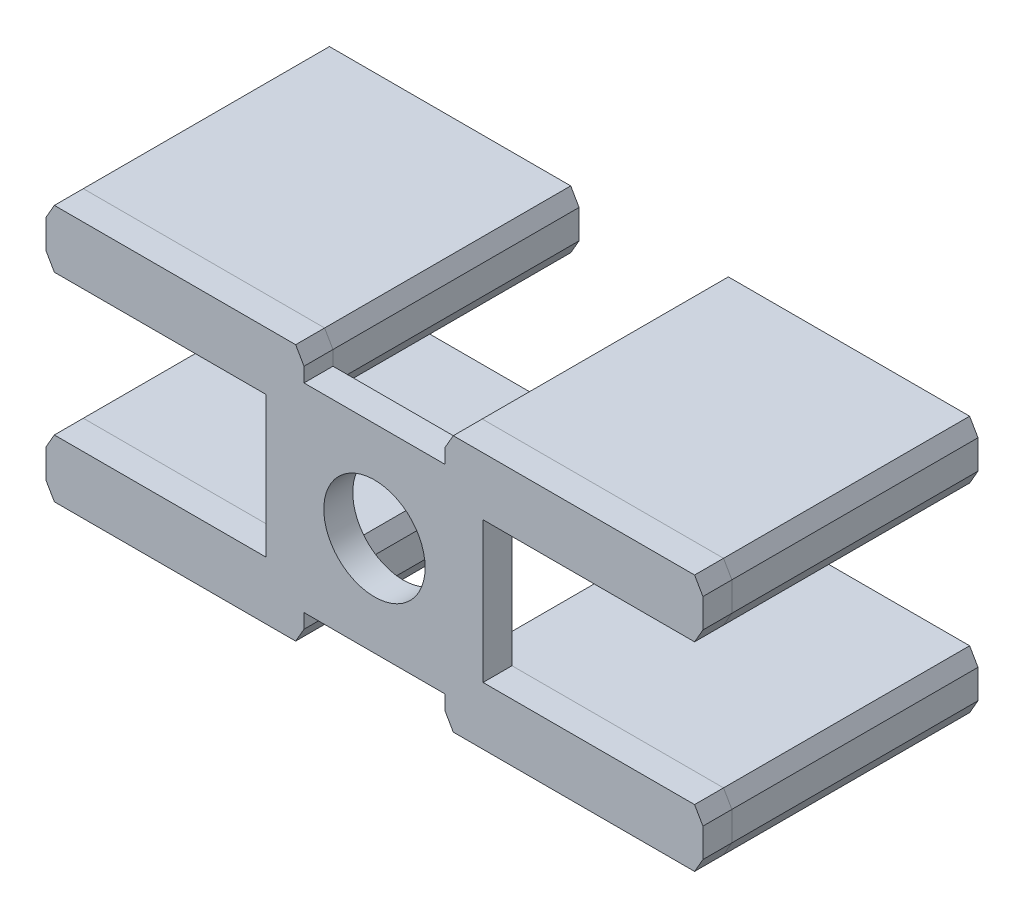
from build123d import *

# Parameters (mm, degrees)
BOSS_EXTRUDE9_DEPTH   = 51
BOSS_EXTRUDE9_2_DEPTH = 51
BOSS_EXTRUDE9_3_DEPTH = 51
BOSS_EXTRUDE9_4_DEPTH = 51
SKETCH19_R            = 10.5
BOSS_EXTRUDE10_DEPTH  = 6


with BuildPart() as part:
    # Sketch18 → Boss-Extrude9 (new body)
    with BuildSketch(Plane.XY):
        Polygon((-66.332050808, 26.6), (-16.332050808, 26.6), (-14.6, 23.6), (-14.6, 17.6), (-16.332050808, 14.6), (-66.332050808, 14.6), (-68.064101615, 17.6), (-68.064101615, 23.6), align=None)
    extrude(amount=BOSS_EXTRUDE9_DEPTH)


with BuildPart() as body_2:
    # Sketch18 → Boss-Extrude9 2 (new body)
    with BuildSketch(Plane.XY):
        Polygon((14.6, 17.6), (16.332050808, 14.6), (66.332050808, 14.6), (68.064101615, 17.6), (68.064101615, 23.6), (66.332050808, 26.6), (16.332050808, 26.6), (14.6, 23.6), align=None)
    extrude(amount=BOSS_EXTRUDE9_2_DEPTH)


with BuildPart() as body_3:
    # Sketch18 → Boss-Extrude9 3 (new body)
    with BuildSketch(Plane.XY):
        Polygon((66.332050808, -26.6), (16.332050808, -26.6), (14.6, -23.6), (14.6, -17.6), (16.332050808, -14.6), (66.332050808, -14.6), (68.064101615, -17.6), (68.064101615, -23.6), align=None)
    extrude(amount=BOSS_EXTRUDE9_3_DEPTH)


with BuildPart() as body_4:
    # Sketch18 → Boss-Extrude9 4 (new body)
    with BuildSketch(Plane.XY):
        Polygon((-14.6, -17.6), (-16.332050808, -14.6), (-66.332050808, -14.6), (-68.064101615, -17.6), (-68.064101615, -23.6), (-66.332050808, -26.6), (-16.332050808, -26.6), (-14.6, -23.6), align=None)
    extrude(amount=BOSS_EXTRUDE9_4_DEPTH)


with BuildPart() as body_5:
    # Sketch19 → Boss-Extrude10 (new body)
    with BuildSketch(Plane.XY.offset(51)):
        Polygon((-66.332050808, 26.6), (-68.064101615, 23.6), (-68.064101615, 17.6), (-66.332050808, 14.6), (-22.5, 14.6), (-22.5, -14.6), (-66.332050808, -14.6), (-68.064101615, -17.6), (-68.064101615, -23.6), (-66.332050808, -26.6), (-16.332050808, -26.6), (-14.6, -23.6), (-14.6, -20.6), (14.6, -20.6), (14.6, -23.6), (16.332050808, -26.6), (66.332050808, -26.6), (68.064101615, -23.6), (68.064101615, -17.6), (66.332050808, -14.6), (22.5, -14.6), (22.5, 14.6), (66.332050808, 14.6), (68.064101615, 17.6), (68.064101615, 23.6), (66.332050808, 26.6), (16.332050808, 26.6), (14.6, 23.6), (14.6, 20.6), (-14.6, 20.6), (-14.6, 23.6), (-16.332050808, 26.6), align=None)
        Circle(SKETCH19_R, mode=Mode.SUBTRACT)
    extrude(amount=BOSS_EXTRUDE10_DEPTH)


solid = Compound([part.part, body_2.part, body_3.part, body_4.part, body_5.part])
